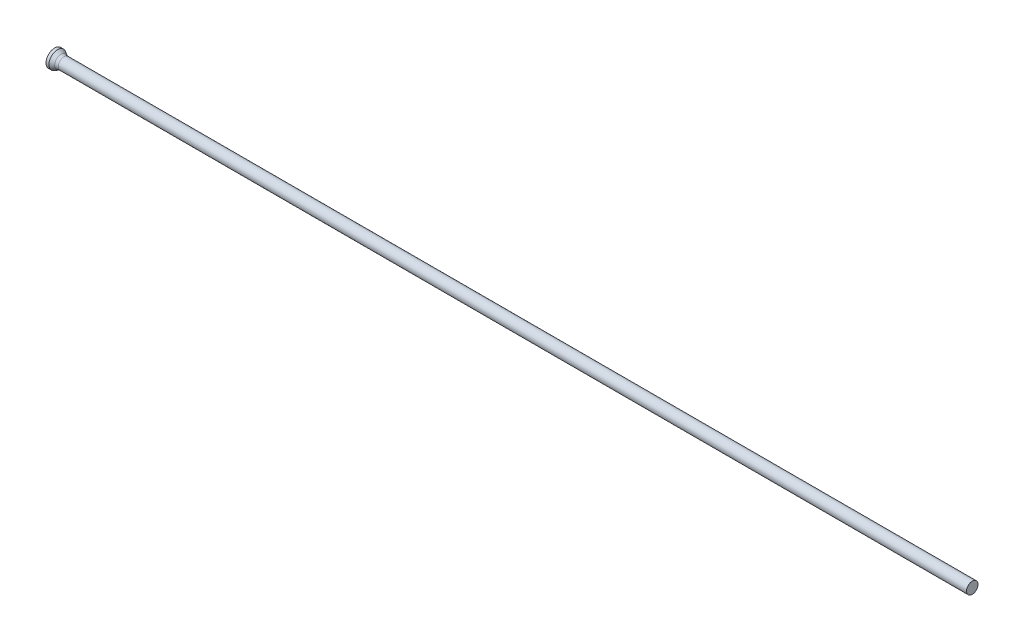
ISO-10303-21;
HEADER;
FILE_DESCRIPTION(('STEP AP214'),'2;1');
FILE_NAME('part.step','',(''),(''),'','','');
FILE_SCHEMA(('AUTOMOTIVE_DESIGN { 1 0 10303 214 1 1 1 1 }'));
ENDSEC;
DATA;
#1=APPLICATION_CONTEXT('core data for automotive mechanical design processes');
#2=APPLICATION_PROTOCOL_DEFINITION('international standard','automotive_design',2000,#1);
#3=PRODUCT_CONTEXT('',#1,'mechanical');
#4=PRODUCT('Part','Part','',(#3));
#5=PRODUCT_RELATED_PRODUCT_CATEGORY('part','',(#4));
#6=PRODUCT_DEFINITION_FORMATION('','',#4);
#7=PRODUCT_DEFINITION_CONTEXT('part definition',#1,'design');
#8=PRODUCT_DEFINITION('design','',#6,#7);
#9=PRODUCT_DEFINITION_SHAPE('','',#8);
#10=(LENGTH_UNIT() NAMED_UNIT(*) SI_UNIT(.MILLI.,.METRE.));
#11=(NAMED_UNIT(*) PLANE_ANGLE_UNIT() SI_UNIT($,.RADIAN.));
#12=(NAMED_UNIT(*) SI_UNIT($,.STERADIAN.) SOLID_ANGLE_UNIT());
#13=UNCERTAINTY_MEASURE_WITH_UNIT(LENGTH_MEASURE(1.E-05),#10,'distance_accuracy_value','');
#14=(GEOMETRIC_REPRESENTATION_CONTEXT(3) GLOBAL_UNCERTAINTY_ASSIGNED_CONTEXT((#13)) GLOBAL_UNIT_ASSIGNED_CONTEXT((#10,
#11,#12)) REPRESENTATION_CONTEXT('',''));
#15=CARTESIAN_POINT('',(0.,0.,0.));
#16=DIRECTION('',(0.,0.,1.));
#17=DIRECTION('',(1.,0.,0.));
#18=AXIS2_PLACEMENT_3D('',#15,#16,#17);
#19=CARTESIAN_POINT('',(0.,0.,0.));
#20=DIRECTION('',(1.,0.,0.));
#21=DIRECTION('',(0.,0.,-1.));
#22=AXIS2_PLACEMENT_3D('',#19,#20,#21);
#23=PLANE('',#22);
#24=CARTESIAN_POINT('',(0.,0.,0.));
#25=DIRECTION('',(-1.,0.,0.));
#26=DIRECTION('',(0.,0.,1.));
#27=AXIS2_PLACEMENT_3D('',#24,#25,#26);
#28=CIRCLE('',#27,1.5);
#29=CARTESIAN_POINT('',(0.,0.,1.5));
#30=VERTEX_POINT('',#29);
#31=EDGE_CURVE('E25',#30,#30,#28,.T.);
#32=ORIENTED_EDGE('',*,*,#31,.T.);
#33=EDGE_LOOP('',(#32));
#34=FACE_BOUND('',#33,.T.);
#35=ADVANCED_FACE('F14',(#34),#23,.F.);
#36=CARTESIAN_POINT('',(0.,0.,0.));
#37=DIRECTION('',(-1.,0.,0.));
#38=DIRECTION('',(0.,0.,1.));
#39=AXIS2_PLACEMENT_3D('',#36,#37,#38);
#40=CYLINDRICAL_SURFACE('',#39,1.5);
#41=ORIENTED_EDGE('',*,*,#31,.F.);
#42=EDGE_LOOP('',(#41));
#43=FACE_BOUND('',#42,.T.);
#44=CARTESIAN_POINT('',(0.503974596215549,0.,0.));
#45=DIRECTION('',(-1.,0.,0.));
#46=DIRECTION('',(0.,0.,1.));
#47=AXIS2_PLACEMENT_3D('',#44,#45,#46);
#48=CIRCLE('',#47,1.5);
#49=CARTESIAN_POINT('',(0.503974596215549,0.,1.5));
#50=VERTEX_POINT('',#49);
#51=EDGE_CURVE('E29',#50,#50,#48,.T.);
#52=ORIENTED_EDGE('',*,*,#51,.T.);
#53=EDGE_LOOP('',(#52));
#54=FACE_BOUND('',#53,.T.);
#55=ADVANCED_FACE('F53',(#43,#54),#40,.T.);
#56=CARTESIAN_POINT('',(1.37,0.,0.));
#57=DIRECTION('',(-1.,0.,0.));
#58=DIRECTION('',(0.,0.,1.));
#59=AXIS2_PLACEMENT_3D('',#56,#57,#58);
#60=CONICAL_SURFACE('',#59,1.,0.523598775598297);
#61=CARTESIAN_POINT('',(1.13794919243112,0.,0.));
#62=DIRECTION('',(-1.,0.,0.));
#63=DIRECTION('',(0.,0.,1.));
#64=AXIS2_PLACEMENT_3D('',#61,#62,#63);
#65=CIRCLE('',#64,1.13397459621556);
#66=CARTESIAN_POINT('',(1.13794919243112,0.,1.13397459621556));
#67=VERTEX_POINT('',#66);
#68=EDGE_CURVE('E21',#67,#67,#65,.T.);
#69=ORIENTED_EDGE('',*,*,#68,.T.);
#70=EDGE_LOOP('',(#69));
#71=FACE_BOUND('',#70,.T.);
#72=ORIENTED_EDGE('',*,*,#51,.F.);
#73=EDGE_LOOP('',(#72));
#74=FACE_BOUND('',#73,.T.);
#75=ADVANCED_FACE('F50',(#71,#74),#60,.T.);
#76=CARTESIAN_POINT('',(0.,0.,0.));
#77=DIRECTION('',(-1.,0.,0.));
#78=DIRECTION('',(0.,0.,1.));
#79=AXIS2_PLACEMENT_3D('',#76,#77,#78);
#80=CYLINDRICAL_SURFACE('',#79,1.);
#81=CARTESIAN_POINT('',(1.63794919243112,0.,0.));
#82=DIRECTION('',(-1.,0.,0.));
#83=DIRECTION('',(0.,0.,1.));
#84=AXIS2_PLACEMENT_3D('',#81,#82,#83);
#85=CIRCLE('',#84,1.);
#86=CARTESIAN_POINT('',(1.63794919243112,0.,1.));
#87=VERTEX_POINT('',#86);
#88=EDGE_CURVE('E9',#87,#87,#85,.F.);
#89=ORIENTED_EDGE('',*,*,#88,.T.);
#90=EDGE_LOOP('',(#89));
#91=FACE_BOUND('',#90,.T.);
#92=CARTESIAN_POINT('',(160.,0.,0.));
#93=DIRECTION('',(-1.,0.,0.));
#94=DIRECTION('',(0.,0.,1.));
#95=AXIS2_PLACEMENT_3D('',#92,#93,#94);
#96=CIRCLE('',#95,1.);
#97=CARTESIAN_POINT('',(160.,0.,1.));
#98=VERTEX_POINT('',#97);
#99=EDGE_CURVE('E34',#98,#98,#96,.T.);
#100=ORIENTED_EDGE('',*,*,#99,.T.);
#101=EDGE_LOOP('',(#100));
#102=FACE_BOUND('',#101,.T.);
#103=ADVANCED_FACE('F38',(#91,#102),#80,.T.);
#104=CARTESIAN_POINT('',(160.,1.,0.));
#105=DIRECTION('',(-1.,0.,0.));
#106=DIRECTION('',(0.,0.,1.));
#107=AXIS2_PLACEMENT_3D('',#104,#105,#106);
#108=PLANE('',#107);
#109=ORIENTED_EDGE('',*,*,#99,.F.);
#110=EDGE_LOOP('',(#109));
#111=FACE_BOUND('',#110,.T.);
#112=ADVANCED_FACE('F40',(#111),#108,.F.);
#113=CARTESIAN_POINT('',(1.63794919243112,0.,0.));
#114=DIRECTION('',(-1.,0.,0.));
#115=DIRECTION('',(0.,0.,1.));
#116=AXIS2_PLACEMENT_3D('',#113,#114,#115);
#117=TOROIDAL_SURFACE('',#116,2.,1.);
#118=ORIENTED_EDGE('',*,*,#88,.F.);
#119=EDGE_LOOP('',(#118));
#120=FACE_BOUND('',#119,.T.);
#121=ORIENTED_EDGE('',*,*,#68,.F.);
#122=EDGE_LOOP('',(#121));
#123=FACE_BOUND('',#122,.T.);
#124=ADVANCED_FACE('F16',(#120,#123),#117,.F.);
#125=CLOSED_SHELL('',(#35,#55,#75,#103,#112,#124));
#126=MANIFOLD_SOLID_BREP('B1',#125);
#127=ADVANCED_BREP_SHAPE_REPRESENTATION('',(#18,#126),#14);
#128=SHAPE_DEFINITION_REPRESENTATION(#9,#127);
ENDSEC;
END-ISO-10303-21;
